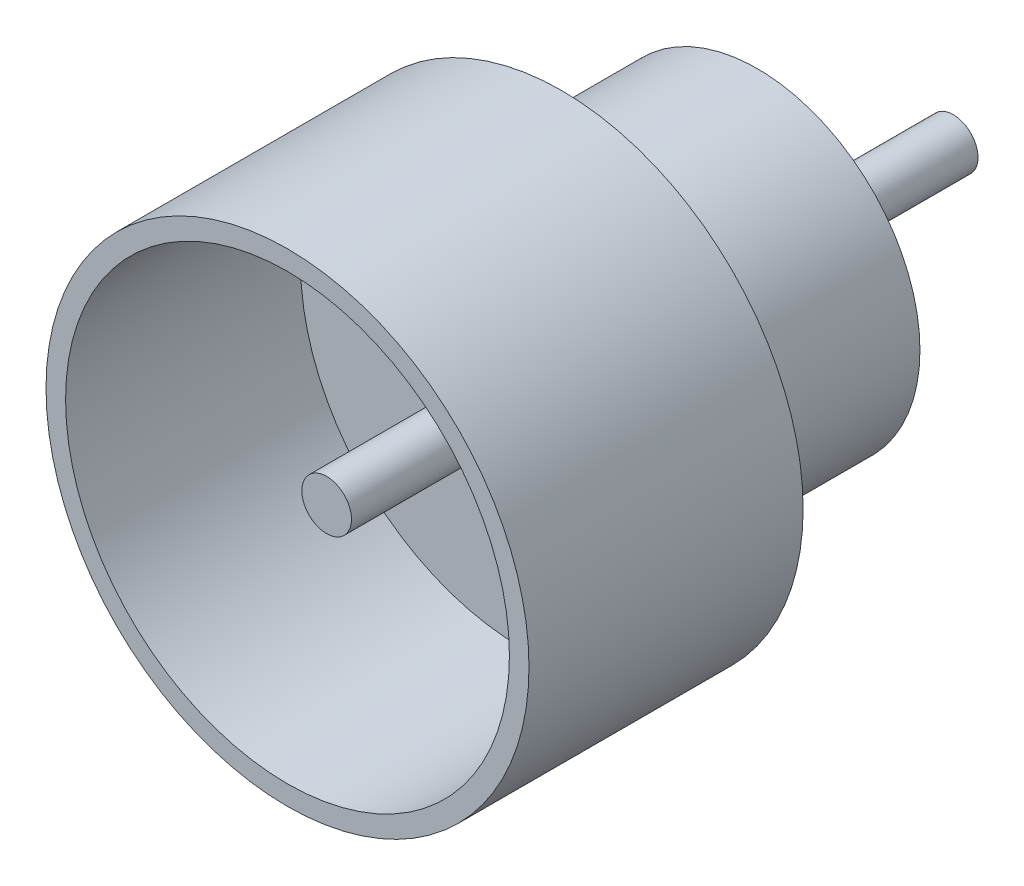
from build123d import *

# Parameters (mm, degrees)
SKETCH_1_R          = 1.85
EXTRUDE_1_DEPTH     = 2.1
SKETCH_2_R          = 1.7
CUT_EXTRUDE_1_DEPTH = 1.8
SKETCH_3_R          = 0.19
EXTRUDE_2_DEPTH     = 1.5
SKETCH_4_R          = 1.245
EXTRUDE_3_DEPTH     = 1.5
EXTRUDE_START       = 1.5
SKETCH_5_R          = 0.19
EXTRUDE_4_DEPTH     = 1.5


with BuildPart() as part:
    # Sketch 1 → Extrude 1 (new body)
    with BuildSketch(Plane.XY):
        Circle(SKETCH_1_R)
    extrude(amount=EXTRUDE_1_DEPTH)

    # Sketch 2 → Cut-Extrude 1 (cut)
    with BuildSketch(Plane.XY.offset(2.1)):
        Circle(SKETCH_2_R)
    extrude(amount=-CUT_EXTRUDE_1_DEPTH, mode=Mode.SUBTRACT)

    # Sketch 3 → Extrude 2 (add)
    with BuildSketch(Plane.XY.offset(0.3)):
        Circle(SKETCH_3_R)
    extrude(amount=EXTRUDE_2_DEPTH)

    # Sketch 4 → Extrude 3 (add)
    with BuildSketch(Plane(origin=(0, 0, 0), x_dir=(-1, 0, 0), z_dir=(0, 0, -1))):
        with Locations(Location((0, 0, 0), (0, 0, 180))):
            Circle(SKETCH_4_R)
    extrude(amount=EXTRUDE_3_DEPTH)

    # Sketch 5 → Extrude 4 (add)
    with BuildSketch(Plane(origin=(0, 0, -1.5), x_dir=(-1, 0, 0), z_dir=(0, 0, -1)).offset(EXTRUDE_START)):
        with Locations(Location((0, 0, 0), (0, 0, 180))):
            Circle(SKETCH_5_R)
    extrude(amount=-EXTRUDE_4_DEPTH)


solid = part.part
